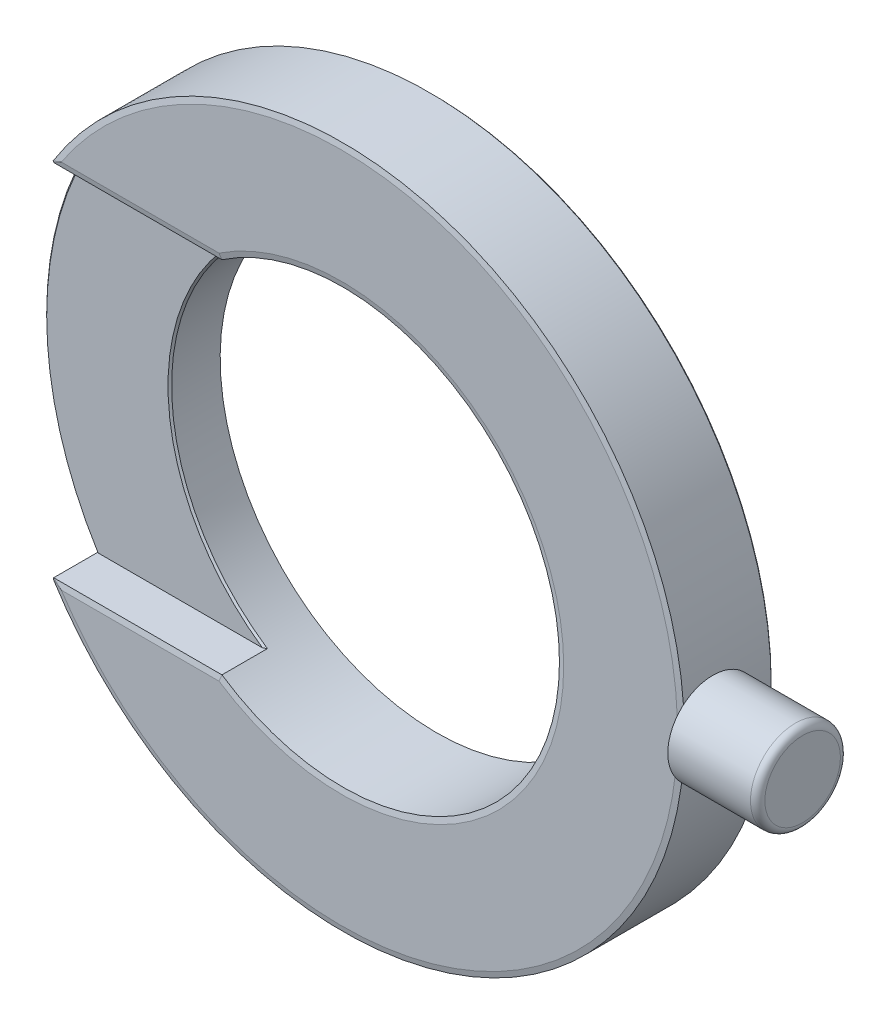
ISO-10303-21;
HEADER;
FILE_DESCRIPTION(('STEP AP214'),'2;1');
FILE_NAME('part.step','',(''),(''),'','','');
FILE_SCHEMA(('AUTOMOTIVE_DESIGN { 1 0 10303 214 1 1 1 1 }'));
ENDSEC;
DATA;
#1=APPLICATION_CONTEXT('core data for automotive mechanical design processes');
#2=APPLICATION_PROTOCOL_DEFINITION('international standard','automotive_design',2000,#1);
#3=PRODUCT_CONTEXT('',#1,'mechanical');
#4=PRODUCT('Part','Part','',(#3));
#5=PRODUCT_RELATED_PRODUCT_CATEGORY('part','',(#4));
#6=PRODUCT_DEFINITION_FORMATION('','',#4);
#7=PRODUCT_DEFINITION_CONTEXT('part definition',#1,'design');
#8=PRODUCT_DEFINITION('design','',#6,#7);
#9=PRODUCT_DEFINITION_SHAPE('','',#8);
#10=(LENGTH_UNIT() NAMED_UNIT(*) SI_UNIT(.MILLI.,.METRE.));
#11=(NAMED_UNIT(*) PLANE_ANGLE_UNIT() SI_UNIT($,.RADIAN.));
#12=(NAMED_UNIT(*) SI_UNIT($,.STERADIAN.) SOLID_ANGLE_UNIT());
#13=UNCERTAINTY_MEASURE_WITH_UNIT(LENGTH_MEASURE(1.E-05),#10,'distance_accuracy_value','');
#14=(GEOMETRIC_REPRESENTATION_CONTEXT(3) GLOBAL_UNCERTAINTY_ASSIGNED_CONTEXT((#13)) GLOBAL_UNIT_ASSIGNED_CONTEXT((#10,
#11,#12)) REPRESENTATION_CONTEXT('',''));
#15=CARTESIAN_POINT('',(0.,0.,0.));
#16=DIRECTION('',(0.,0.,1.));
#17=DIRECTION('',(1.,0.,0.));
#18=AXIS2_PLACEMENT_3D('',#15,#16,#17);
#19=CARTESIAN_POINT('',(0.,0.,1.5));
#20=DIRECTION('',(0.,0.,-1.));
#21=DIRECTION('',(-1.,0.,0.));
#22=AXIS2_PLACEMENT_3D('',#19,#20,#21);
#23=PLANE('',#22);
#24=CARTESIAN_POINT('',(0.,0.,1.5));
#25=DIRECTION('',(0.,0.,-1.));
#26=DIRECTION('',(-1.,0.,0.));
#27=AXIS2_PLACEMENT_3D('',#24,#25,#26);
#28=CIRCLE('',#27,94.5);
#29=CARTESIAN_POINT('',(-94.5,0.,1.5));
#30=VERTEX_POINT('',#29);
#31=EDGE_CURVE('E340',#30,#30,#28,.T.);
#32=ORIENTED_EDGE('',*,*,#31,.T.);
#33=EDGE_LOOP('',(#32));
#34=FACE_BOUND('',#33,.T.);
#35=CARTESIAN_POINT('',(0.,0.,1.5));
#36=DIRECTION('',(0.,0.,-1.));
#37=DIRECTION('',(1.,0.,0.));
#38=AXIS2_PLACEMENT_3D('',#35,#36,#37);
#39=CIRCLE('',#38,63.25);
#40=CARTESIAN_POINT('',(63.25,0.,1.5));
#41=VERTEX_POINT('',#40);
#42=EDGE_CURVE('E453',#41,#41,#39,.T.);
#43=ORIENTED_EDGE('',*,*,#42,.F.);
#44=EDGE_LOOP('',(#43));
#45=FACE_BOUND('',#44,.T.);
#46=ADVANCED_FACE('F15',(#34,#45),#23,.T.);
#47=CARTESIAN_POINT('',(97.250000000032,-12.5,20.5));
#48=DIRECTION('',(-1.,0.,0.));
#49=DIRECTION('',(0.,-1.,0.));
#50=AXIS2_PLACEMENT_3D('',#47,#48,#49);
#51=PLANE('',#50);
#52=CARTESIAN_POINT('',(97.250000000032,0.,20.5));
#53=DIRECTION('',(-1.,0.,0.));
#54=DIRECTION('',(0.,-1.,0.));
#55=AXIS2_PLACEMENT_3D('',#52,#53,#54);
#56=CIRCLE('',#55,3.99999999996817);
#57=CARTESIAN_POINT('',(97.250000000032,-3.99999999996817,20.5));
#58=VERTEX_POINT('',#57);
#59=EDGE_CURVE('E28',#58,#58,#56,.F.);
#60=ORIENTED_EDGE('',*,*,#59,.T.);
#61=EDGE_LOOP('',(#60));
#62=FACE_BOUND('',#61,.T.);
#63=CARTESIAN_POINT('',(97.250000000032,0.,20.5));
#64=DIRECTION('',(1.,0.,0.));
#65=DIRECTION('',(0.,1.,0.));
#66=AXIS2_PLACEMENT_3D('',#63,#64,#65);
#67=CIRCLE('',#66,12.5);
#68=CARTESIAN_POINT('',(97.250000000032,12.5,20.5));
#69=VERTEX_POINT('',#68);
#70=EDGE_CURVE('E708',#69,#69,#67,.T.);
#71=ORIENTED_EDGE('',*,*,#70,.F.);
#72=EDGE_LOOP('',(#71));
#73=FACE_BOUND('',#72,.T.);
#74=ADVANCED_FACE('F261',(#62,#73),#51,.T.);
#75=CARTESIAN_POINT('',(97.250000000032,0.,20.5));
#76=DIRECTION('',(1.,0.,0.));
#77=DIRECTION('',(0.,1.,0.));
#78=AXIS2_PLACEMENT_3D('',#75,#76,#77);
#79=CYLINDRICAL_SURFACE('',#78,12.5);
#80=CARTESIAN_POINT('',(120.250000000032,0.,20.5));
#81=DIRECTION('',(1.,0.,0.));
#82=DIRECTION('',(0.,1.,0.));
#83=AXIS2_PLACEMENT_3D('',#80,#81,#82);
#84=CIRCLE('',#83,12.5);
#85=CARTESIAN_POINT('',(120.250000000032,12.5,20.5));
#86=VERTEX_POINT('',#85);
#87=EDGE_CURVE('E703',#86,#86,#84,.T.);
#88=ORIENTED_EDGE('',*,*,#87,.F.);
#89=EDGE_LOOP('',(#88));
#90=FACE_BOUND('',#89,.T.);
#91=ORIENTED_EDGE('',*,*,#70,.T.);
#92=EDGE_LOOP('',(#91));
#93=FACE_BOUND('',#92,.T.);
#94=ADVANCED_FACE('F264',(#90,#93),#79,.T.);
#95=CARTESIAN_POINT('',(120.250000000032,0.,20.5));
#96=DIRECTION('',(1.,0.,0.));
#97=DIRECTION('',(0.,1.,0.));
#98=AXIS2_PLACEMENT_3D('',#95,#96,#97);
#99=TOROIDAL_SURFACE('',#98,10.5,2.);
#100=CARTESIAN_POINT('',(122.250000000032,0.,20.5));
#101=DIRECTION('',(1.,0.,0.));
#102=DIRECTION('',(0.,1.,0.));
#103=AXIS2_PLACEMENT_3D('',#100,#101,#102);
#104=CIRCLE('',#103,10.5);
#105=CARTESIAN_POINT('',(122.250000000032,10.5,20.5));
#106=VERTEX_POINT('',#105);
#107=EDGE_CURVE('E464',#106,#106,#104,.T.);
#108=ORIENTED_EDGE('',*,*,#107,.F.);
#109=EDGE_LOOP('',(#108));
#110=FACE_BOUND('',#109,.T.);
#111=ORIENTED_EDGE('',*,*,#87,.T.);
#112=EDGE_LOOP('',(#111));
#113=FACE_BOUND('',#112,.T.);
#114=ADVANCED_FACE('F259',(#110,#113),#99,.T.);
#115=CARTESIAN_POINT('',(122.250000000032,0.,20.5));
#116=DIRECTION('',(1.,0.,0.));
#117=DIRECTION('',(0.,0.,-1.));
#118=AXIS2_PLACEMENT_3D('',#115,#116,#117);
#119=PLANE('',#118);
#120=ORIENTED_EDGE('',*,*,#107,.T.);
#121=EDGE_LOOP('',(#120));
#122=FACE_BOUND('',#121,.T.);
#123=ADVANCED_FACE('F241',(#122),#119,.T.);
#124=CARTESIAN_POINT('',(115.250000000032,0.,20.5));
#125=DIRECTION('',(-1.,0.,0.));
#126=DIRECTION('',(0.,-1.,0.));
#127=AXIS2_PLACEMENT_3D('',#124,#125,#126);
#128=CYLINDRICAL_SURFACE('',#127,3.99999999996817);
#129=ORIENTED_EDGE('',*,*,#59,.F.);
#130=EDGE_LOOP('',(#129));
#131=FACE_BOUND('',#130,.T.);
#132=CARTESIAN_POINT('',(94.9157521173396,-3.99999999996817,20.5));
#133=CARTESIAN_POINT('',(94.9157532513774,-3.99999007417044,20.7245748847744));
#134=CARTESIAN_POINT('',(94.916557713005,-3.98102379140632,20.9493100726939));
#135=CARTESIAN_POINT('',(94.9196892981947,-3.90563082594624,21.3925837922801));
#136=CARTESIAN_POINT('',(94.9220182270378,-3.84915972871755,21.6111146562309));
#137=CARTESIAN_POINT('',(94.9279344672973,-3.70037416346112,22.0354941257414));
#138=CARTESIAN_POINT('',(94.9315211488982,-3.60807763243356,22.2413490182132));
#139=CARTESIAN_POINT('',(94.939547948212,-3.39028788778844,22.634587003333));
#140=CARTESIAN_POINT('',(94.9439878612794,-3.26480263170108,22.8219745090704));
#141=CARTESIAN_POINT('',(94.9532247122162,-2.98408980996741,23.1731574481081));
#142=CARTESIAN_POINT('',(94.9580218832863,-2.82884271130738,23.3369372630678));
#143=CARTESIAN_POINT('',(94.9674304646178,-2.49305079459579,23.636123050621));
#144=CARTESIAN_POINT('',(94.9720418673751,-2.31250495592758,23.7715278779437));
#145=CARTESIAN_POINT('',(94.980560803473,-1.93116545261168,24.010157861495));
#146=CARTESIAN_POINT('',(94.9844680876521,-1.73036465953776,24.1133716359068));
#147=CARTESIAN_POINT('',(94.9911362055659,-1.31426560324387,24.2846163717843));
#148=CARTESIAN_POINT('',(94.9938970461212,-1.09896742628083,24.3526475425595));
#149=CARTESIAN_POINT('',(94.9979596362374,-0.660121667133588,24.4515568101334));
#150=CARTESIAN_POINT('',(94.9992622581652,-0.436579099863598,24.4824571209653));
#151=CARTESIAN_POINT('',(95.0002645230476,0.0125237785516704,24.5062960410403));
#152=CARTESIAN_POINT('',(94.999964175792,0.238084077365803,24.4992348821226));
#153=CARTESIAN_POINT('',(94.9977950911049,0.684669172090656,24.4473698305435));
#154=CARTESIAN_POINT('',(94.9959273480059,0.905696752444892,24.4025898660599));
#155=CARTESIAN_POINT('',(94.9908350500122,1.33709470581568,24.276595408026));
#156=CARTESIAN_POINT('',(94.9876104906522,1.5474650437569,24.1953807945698));
#157=CARTESIAN_POINT('',(94.9801661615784,1.9516539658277,23.9987950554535));
#158=CARTESIAN_POINT('',(94.9759460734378,2.14546722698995,23.883412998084));
#159=CARTESIAN_POINT('',(94.9669860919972,2.51098210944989,23.621775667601));
#160=CARTESIAN_POINT('',(94.9622461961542,2.68268362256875,23.4755202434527));
#161=CARTESIAN_POINT('',(94.9527762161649,2.99924054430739,23.1561524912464));
#162=CARTESIAN_POINT('',(94.9480461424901,3.14407501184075,22.9830194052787));
#163=CARTESIAN_POINT('',(94.939132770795,3.40262525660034,22.6148839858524));
#164=CARTESIAN_POINT('',(94.9349494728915,3.51634102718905,22.4198816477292));
#165=CARTESIAN_POINT('',(94.9276016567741,3.70942388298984,22.0135308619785));
#166=CARTESIAN_POINT('',(94.9244371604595,3.7887902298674,21.802182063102));
#167=CARTESIAN_POINT('',(94.9194846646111,3.91090756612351,21.3691433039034));
#168=CARTESIAN_POINT('',(94.9176966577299,3.95365875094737,21.1474533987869));
#169=CARTESIAN_POINT('',(94.9157001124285,4.00130640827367,20.7002077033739));
#170=CARTESIAN_POINT('',(94.9154903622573,4.00623192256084,20.474655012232));
#171=CARTESIAN_POINT('',(94.9166708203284,3.97816416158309,20.025926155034));
#172=CARTESIAN_POINT('',(94.9180610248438,3.94517097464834,19.8027499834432));
#173=CARTESIAN_POINT('',(94.9222835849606,3.84222643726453,19.3651906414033));
#174=CARTESIAN_POINT('',(94.9251154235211,3.77228833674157,19.1508043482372));
#175=CARTESIAN_POINT('',(94.9319016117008,3.59745267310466,18.7368143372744));
#176=CARTESIAN_POINT('',(94.935855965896,3.4925549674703,18.5372106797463));
#177=CARTESIAN_POINT('',(94.9444444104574,3.25070306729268,18.1583182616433));
#178=CARTESIAN_POINT('',(94.9490789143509,3.11372934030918,17.9790419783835));
#179=CARTESIAN_POINT('',(94.9585038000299,2.81164217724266,17.6460187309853));
#180=CARTESIAN_POINT('',(94.9632941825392,2.64652861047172,17.4922718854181));
#181=CARTESIAN_POINT('',(94.9724943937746,2.29272414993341,17.2145745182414));
#182=CARTESIAN_POINT('',(94.9769039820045,2.10401853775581,17.090642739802));
#183=CARTESIAN_POINT('',(94.9848421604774,1.70846130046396,16.8762215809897));
#184=CARTESIAN_POINT('',(94.9883707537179,1.50160973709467,16.7857320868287));
#185=CARTESIAN_POINT('',(94.9941480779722,1.07570250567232,16.6407970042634));
#186=CARTESIAN_POINT('',(94.9963972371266,0.856650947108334,16.5863393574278));
#187=CARTESIAN_POINT('',(94.9993638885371,0.412504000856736,16.5149743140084));
#188=CARTESIAN_POINT('',(95.0000813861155,0.187408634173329,16.4980667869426));
#189=CARTESIAN_POINT('',(94.9999038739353,-0.26224985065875,16.5022832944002));
#190=CARTESIAN_POINT('',(94.9990101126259,-0.486813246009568,16.5233778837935));
#191=CARTESIAN_POINT('',(94.9957131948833,-0.929207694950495,16.6029390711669));
#192=CARTESIAN_POINT('',(94.9933100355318,-1.1470387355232,16.6614057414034));
#193=CARTESIAN_POINT('',(94.9872648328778,-1.569792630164,16.8140459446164));
#194=CARTESIAN_POINT('',(94.9836227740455,-1.77471532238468,16.9082199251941));
#195=CARTESIAN_POINT('',(94.9755097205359,-2.16584072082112,17.1295952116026));
#196=CARTESIAN_POINT('',(94.97103875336,-2.35204404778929,17.2567954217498));
#197=CARTESIAN_POINT('',(94.9617675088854,-2.70058946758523,17.5407135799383));
#198=CARTESIAN_POINT('',(94.9569670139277,-2.86291556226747,17.6974511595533));
#199=CARTESIAN_POINT('',(94.9475788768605,-3.1589985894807,18.035998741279));
#200=CARTESIAN_POINT('',(94.9429912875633,-3.29274846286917,18.2178149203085));
#201=CARTESIAN_POINT('',(94.934543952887,-3.52792680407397,18.6014687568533));
#202=CARTESIAN_POINT('',(94.9306848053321,-3.62932877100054,18.8033226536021));
#203=CARTESIAN_POINT('',(94.9241395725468,-3.79668366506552,19.2210531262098));
#204=CARTESIAN_POINT('',(94.9214520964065,-3.86267864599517,19.4369127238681));
#205=CARTESIAN_POINT('',(94.918267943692,-3.93995421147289,19.7951031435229));
#206=CARTESIAN_POINT('',(94.9173286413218,-3.96244282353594,19.9351116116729));
#207=CARTESIAN_POINT('',(94.9160703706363,-3.99246884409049,20.2167254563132));
#208=CARTESIAN_POINT('',(94.9157514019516,-4.00000626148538,20.3583308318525));
#209=CARTESIAN_POINT('',(94.9157521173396,-3.99999999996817,20.5));
#210=B_SPLINE_CURVE_WITH_KNOTS('',3,(#132,#133,#134,#135,#136,#137,#138,#139,#140,#141,#142,
#143,#144,#145,#146,#147,#148,#149,#150,#151,#152,#153,#154,#155,#156,#157,#158,#159,#160,#161,
#162,#163,#164,#165,#166,#167,#168,#169,#170,#171,#172,#173,#174,#175,#176,#177,#178,#179,#180,
#181,#182,#183,#184,#185,#186,#187,#188,#189,#190,#191,#192,#193,#194,#195,#196,#197,#198,#199,
#200,#201,#202,#203,#204,#205,#206,#207,#208,#209),.UNSPECIFIED.,.T.,.F.,(4,2,2,2,2,2,2,2,2,2,2,
2,2,2,2,2,2,2,2,2,2,2,2,2,2,2,2,2,2,2,2,2,2,2,2,2,2,2,4),(0.,0.673207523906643,1.34721370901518,
2.02088286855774,2.69439065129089,3.36834198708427,4.04232051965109,4.71653708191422,
5.39074963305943,6.06455862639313,6.73836350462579,7.41174125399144,8.08512121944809,
8.75871686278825,9.43231580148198,10.1064375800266,10.7805595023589,11.454695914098,
12.1288287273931,12.8024439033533,13.476057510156,14.1494296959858,14.8228046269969,
15.4965906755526,16.170379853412,16.8445915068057,17.5188008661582,18.1927844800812,
18.8667657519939,19.5402250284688,20.2136856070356,20.8871546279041,21.5606013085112,
22.2344971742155,22.9085593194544,23.583172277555,24.2569821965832,24.6816637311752,
25.1063450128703),.UNSPECIFIED.);
#211=CARTESIAN_POINT('',(94.9157521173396,-3.99999999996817,20.5));
#212=VERTEX_POINT('',#211);
#213=EDGE_CURVE('E226',#212,#212,#210,.T.);
#214=ORIENTED_EDGE('',*,*,#213,.F.);
#215=EDGE_LOOP('',(#214));
#216=FACE_BOUND('',#215,.T.);
#217=ADVANCED_FACE('F218',(#131,#216),#128,.T.);
#218=CARTESIAN_POINT('',(60.25,0.,20.5));
#219=DIRECTION('',(1.,0.,0.));
#220=DIRECTION('',(0.,1.,0.));
#221=AXIS2_PLACEMENT_3D('',#218,#219,#220);
#222=CONICAL_SURFACE('',#221,2.9999999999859,0.785398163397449);
#223=CARTESIAN_POINT('',(60.25,0.,20.5));
#224=DIRECTION('',(-1.,0.,0.));
#225=DIRECTION('',(0.,-1.,0.));
#226=AXIS2_PLACEMENT_3D('',#223,#224,#225);
#227=CIRCLE('',#226,2.9999999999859);
#228=CARTESIAN_POINT('',(60.25,-2.9999999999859,20.5));
#229=VERTEX_POINT('',#228);
#230=EDGE_CURVE('E460',#229,#229,#227,.T.);
#231=ORIENTED_EDGE('',*,*,#230,.F.);
#232=EDGE_LOOP('',(#231));
#233=FACE_BOUND('',#232,.T.);
#234=CARTESIAN_POINT('',(60.6500000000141,0.,20.5));
#235=DIRECTION('',(1.,0.,0.));
#236=DIRECTION('',(0.,1.,0.));
#237=AXIS2_PLACEMENT_3D('',#234,#235,#236);
#238=CIRCLE('',#237,3.4);
#239=CARTESIAN_POINT('',(60.6500000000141,3.4,20.5));
#240=VERTEX_POINT('',#239);
#241=EDGE_CURVE('E234',#240,#240,#238,.F.);
#242=ORIENTED_EDGE('',*,*,#241,.T.);
#243=EDGE_LOOP('',(#242));
#244=FACE_BOUND('',#243,.T.);
#245=ADVANCED_FACE('F240',(#233,#244),#222,.T.);
#246=CARTESIAN_POINT('',(60.25,0.,20.5));
#247=DIRECTION('',(-1.,0.,0.));
#248=DIRECTION('',(0.,-1.,0.));
#249=AXIS2_PLACEMENT_3D('',#246,#247,#248);
#250=PLANE('',#249);
#251=ORIENTED_EDGE('',*,*,#230,.T.);
#252=EDGE_LOOP('',(#251));
#253=FACE_BOUND('',#252,.T.);
#254=ADVANCED_FACE('F216',(#253),#250,.T.);
#255=CARTESIAN_POINT('',(0.,0.,26.5));
#256=DIRECTION('',(0.,0.,1.));
#257=DIRECTION('',(1.,0.,0.));
#258=AXIS2_PLACEMENT_3D('',#255,#256,#257);
#259=CONICAL_SURFACE('',#258,61.7998990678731,1.33965999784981);
#260=CARTESIAN_POINT('',(0.,0.,26.1352431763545));
#261=DIRECTION('',(0.,0.,1.));
#262=DIRECTION('',(1.,0.,0.));
#263=AXIS2_PLACEMENT_3D('',#260,#261,#262);
#264=CIRCLE('',#263,60.25);
#265=CARTESIAN_POINT('',(-33.6164022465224,-50.,26.1352431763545));
#266=VERTEX_POINT('',#265);
#267=CARTESIAN_POINT('',(-33.6164022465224,50.,26.1352431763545));
#268=VERTEX_POINT('',#267);
#269=EDGE_CURVE('E393',#266,#268,#264,.T.);
#270=ORIENTED_EDGE('',*,*,#269,.F.);
#271=CARTESIAN_POINT('',(389.63811040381,-172.276727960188,54.9121305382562));
#272=DIRECTION('',(2.69255548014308E-12,-0.229083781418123,-0.973406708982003));
#273=DIRECTION('',(-0.958669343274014,0.27695617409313,-0.0651795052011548));
#274=AXIS2_PLACEMENT_3D('',#271,#272,#273);
#275=CIRCLE('',#274,441.502083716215);
#276=CARTESIAN_POINT('',(-34.0857071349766,-51.5498990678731,26.5));
#277=VERTEX_POINT('',#276);
#278=EDGE_CURVE('E388',#277,#266,#275,.T.);
#279=ORIENTED_EDGE('',*,*,#278,.F.);
#280=CARTESIAN_POINT('',(0.,0.,26.5));
#281=DIRECTION('',(0.,0.,-1.));
#282=DIRECTION('',(1.,0.,0.));
#283=AXIS2_PLACEMENT_3D('',#280,#281,#282);
#284=CIRCLE('',#283,61.7998990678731);
#285=CARTESIAN_POINT('',(-34.0857071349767,51.5498990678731,26.5));
#286=VERTEX_POINT('',#285);
#287=EDGE_CURVE('E392',#286,#277,#284,.T.);
#288=ORIENTED_EDGE('',*,*,#287,.F.);
#289=CARTESIAN_POINT('',(389.638110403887,172.276727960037,54.9121305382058));
#290=DIRECTION('',(-2.66336566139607E-12,-0.229083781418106,0.973406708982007));
#291=DIRECTION('',(-0.958669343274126,-0.27695617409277,-0.0651795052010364));
#292=AXIS2_PLACEMENT_3D('',#289,#290,#291);
#293=CIRCLE('',#292,441.502083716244);
#294=EDGE_CURVE('E145',#286,#268,#293,.T.);
#295=ORIENTED_EDGE('',*,*,#294,.T.);
#296=EDGE_LOOP('',(#270,#279,#288,#295));
#297=FACE_BOUND('',#296,.T.);
#298=ADVANCED_FACE('F204',(#297),#259,.F.);
#299=CARTESIAN_POINT('',(0.,0.,1.5));
#300=DIRECTION('',(0.,0.,1.));
#301=DIRECTION('',(1.,0.,0.));
#302=AXIS2_PLACEMENT_3D('',#299,#300,#301);
#303=CONICAL_SURFACE('',#302,94.5,0.785398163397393);
#304=CARTESIAN_POINT('',(0.,0.,2.));
#305=DIRECTION('',(0.,0.,1.));
#306=DIRECTION('',(-1.,0.,0.));
#307=AXIS2_PLACEMENT_3D('',#304,#305,#306);
#308=CIRCLE('',#307,95.);
#309=CARTESIAN_POINT('',(-95.,0.,2.));
#310=VERTEX_POINT('',#309);
#311=EDGE_CURVE('E336',#310,#310,#308,.T.);
#312=ORIENTED_EDGE('',*,*,#311,.F.);
#313=EDGE_LOOP('',(#312));
#314=FACE_BOUND('',#313,.T.);
#315=ORIENTED_EDGE('',*,*,#31,.F.);
#316=EDGE_LOOP('',(#315));
#317=FACE_BOUND('',#316,.T.);
#318=ADVANCED_FACE('F200',(#314,#317),#303,.T.);
#319=CARTESIAN_POINT('',(0.,0.,14.));
#320=DIRECTION('',(0.,0.,-1.));
#321=DIRECTION('',(-1.,0.,0.));
#322=AXIS2_PLACEMENT_3D('',#319,#320,#321);
#323=CONICAL_SURFACE('',#322,94.5,0.785398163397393);
#324=CARTESIAN_POINT('',(0.,0.,14.));
#325=DIRECTION('',(0.,0.,1.));
#326=DIRECTION('',(1.,0.,0.));
#327=AXIS2_PLACEMENT_3D('',#324,#325,#326);
#328=CIRCLE('',#327,94.5);
#329=CARTESIAN_POINT('',(-80.1888396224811,50.,14.));
#330=VERTEX_POINT('',#329);
#331=CARTESIAN_POINT('',(-80.1888396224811,-50.,14.));
#332=VERTEX_POINT('',#331);
#333=EDGE_CURVE('E162',#330,#332,#328,.T.);
#334=ORIENTED_EDGE('',*,*,#333,.F.);
#335=DIRECTION('',(0.762433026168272,0.,0.647067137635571));
#336=VECTOR('',#335,1.);
#337=CARTESIAN_POINT('',(-80.2753460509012,50.,13.9265831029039));
#338=LINE('',#337,#336);
#339=CARTESIAN_POINT('',(-80.2753460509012,50.,13.9265831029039));
#340=VERTEX_POINT('',#339);
#341=EDGE_CURVE('E324',#340,#330,#338,.T.);
#342=ORIENTED_EDGE('',*,*,#341,.F.);
#343=CARTESIAN_POINT('',(-80.2753460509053,49.9999999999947,13.9265831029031));
#344=CARTESIAN_POINT('',(-80.42981794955,50.1544718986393,13.7137973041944));
#345=CARTESIAN_POINT('',(-80.5849866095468,50.3096405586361,13.4999999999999));
#346=(BOUNDED_CURVE() B_SPLINE_CURVE(2,(#343,#344,#345),.UNSPECIFIED.,.F.,
.F.) B_SPLINE_CURVE_WITH_KNOTS((3,3),(-0.189217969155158,-0.132312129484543),
.UNSPECIFIED.) CURVE() GEOMETRIC_REPRESENTATION_ITEM() RATIONAL_B_SPLINE_CURVE((1.00059581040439,
1.00051508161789,1.0004290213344)) REPRESENTATION_ITEM(''));
#347=CARTESIAN_POINT('',(-80.5849866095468,50.3096405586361,13.5));
#348=VERTEX_POINT('',#347);
#349=EDGE_CURVE('E329',#340,#348,#346,.T.);
#350=ORIENTED_EDGE('',*,*,#349,.T.);
#351=CARTESIAN_POINT('',(0.,0.,13.5));
#352=DIRECTION('',(0.,0.,-1.));
#353=DIRECTION('',(1.,0.,0.));
#354=AXIS2_PLACEMENT_3D('',#351,#352,#353);
#355=CIRCLE('',#354,95.);
#356=CARTESIAN_POINT('',(-80.5127675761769,-50.4251351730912,13.5));
#357=VERTEX_POINT('',#356);
#358=EDGE_CURVE('E380',#357,#348,#355,.T.);
#359=ORIENTED_EDGE('',*,*,#358,.F.);
#360=CARTESIAN_POINT('',(-80.5127675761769,-50.4251351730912,13.5));
#361=CARTESIAN_POINT('',(-80.4794347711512,-50.2834997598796,13.6034284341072));
#362=CARTESIAN_POINT('',(-80.4460840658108,-50.1417882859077,13.7067470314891));
#363=CARTESIAN_POINT('',(-80.412715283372,-50.,13.8099541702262));
#364=(BOUNDED_CURVE() B_SPLINE_CURVE(3,(#360,#361,#362,#363),.UNSPECIFIED.,.F.,
.F.) B_SPLINE_CURVE_WITH_KNOTS((4,4),(0.,0.000535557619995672),
.UNSPECIFIED.) CURVE() GEOMETRIC_REPRESENTATION_ITEM() RATIONAL_B_SPLINE_CURVE((1.,1.,1.,1.)) REPRESENTATION_ITEM(''));
#365=CARTESIAN_POINT('',(-80.412715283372,-50.,13.8099541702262));
#366=VERTEX_POINT('',#365);
#367=EDGE_CURVE('E355',#357,#366,#364,.T.);
#368=ORIENTED_EDGE('',*,*,#367,.T.);
#369=CARTESIAN_POINT('',(-80.1888396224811,-50.,14.));
#370=CARTESIAN_POINT('',(-80.2634770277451,-50.,13.9366657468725));
#371=CARTESIAN_POINT('',(-80.338102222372,-50.,13.873317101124));
#372=CARTESIAN_POINT('',(-80.412715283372,-50.,13.8099541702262));
#373=(BOUNDED_CURVE() B_SPLINE_CURVE(3,(#369,#370,#371,#372),.UNSPECIFIED.,.F.,
.F.) B_SPLINE_CURVE_WITH_KNOTS((4,4),(0.,0.00029366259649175),
.UNSPECIFIED.) CURVE() GEOMETRIC_REPRESENTATION_ITEM() RATIONAL_B_SPLINE_CURVE((1.,1.,1.,1.)) REPRESENTATION_ITEM(''));
#374=EDGE_CURVE('E334',#332,#366,#373,.T.);
#375=ORIENTED_EDGE('',*,*,#374,.F.);
#376=EDGE_LOOP('',(#334,#342,#350,#359,#368,#375));
#377=FACE_BOUND('',#376,.T.);
#378=ADVANCED_FACE('F203',(#377),#323,.T.);
#379=CARTESIAN_POINT('',(95.,0.,20.5));
#380=DIRECTION('',(1.,0.,0.));
#381=DIRECTION('',(0.,1.,0.));
#382=AXIS2_PLACEMENT_3D('',#379,#380,#381);
#383=CYLINDRICAL_SURFACE('',#382,3.4);
#384=ORIENTED_EDGE('',*,*,#241,.F.);
#385=EDGE_LOOP('',(#384));
#386=FACE_BOUND('',#385,.T.);
#387=CARTESIAN_POINT('',(60.25,-1.26403377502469E-13,23.9));
#388=CARTESIAN_POINT('',(60.2500002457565,-0.0542884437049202,23.9000042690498));
#389=CARTESIAN_POINT('',(60.2499266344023,-0.108574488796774,23.8986545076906));
#390=CARTESIAN_POINT('',(60.2496327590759,-0.217287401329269,23.8932862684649));
#391=CARTESIAN_POINT('',(60.2494117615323,-0.271713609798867,23.8892544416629));
#392=CARTESIAN_POINT('',(60.2488220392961,-0.380705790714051,23.8785229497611));
#393=CARTESIAN_POINT('',(60.2484522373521,-0.43526983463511,23.8718038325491));
#394=CARTESIAN_POINT('',(60.2475641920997,-0.544538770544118,23.8557068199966));
#395=CARTESIAN_POINT('',(60.2470445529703,-0.599239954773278,23.8463039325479));
#396=CARTESIAN_POINT('',(60.2458460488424,-0.70969732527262,23.8246590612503));
#397=CARTESIAN_POINT('',(60.2451630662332,-0.765439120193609,23.8123437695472));
#398=CARTESIAN_POINT('',(60.2436600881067,-0.875747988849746,23.785094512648));
#399=CARTESIAN_POINT('',(60.2428413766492,-0.930321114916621,23.7701850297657));
#400=CARTESIAN_POINT('',(60.2410768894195,-1.03829245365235,23.737755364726));
#401=CARTESIAN_POINT('',(60.2401319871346,-1.09169604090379,23.7202530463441));
#402=CARTESIAN_POINT('',(60.2381248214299,-1.1973291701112,23.6826445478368));
#403=CARTESIAN_POINT('',(60.237063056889,-1.2495626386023,23.6625493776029));
#404=CARTESIAN_POINT('',(60.234830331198,-1.35291761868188,23.6197349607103));
#405=CARTESIAN_POINT('',(60.2336594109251,-1.40403953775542,23.597016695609));
#406=CARTESIAN_POINT('',(60.2312142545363,-1.50529248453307,23.5489251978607));
#407=CARTESIAN_POINT('',(60.2299395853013,-1.5554181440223,23.523540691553));
#408=CARTESIAN_POINT('',(60.2272945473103,-1.65468235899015,23.4701236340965));
#409=CARTESIAN_POINT('',(60.2259235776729,-1.7038116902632,23.4420739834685));
#410=CARTESIAN_POINT('',(60.2230933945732,-1.80108640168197,23.383331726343));
#411=CARTESIAN_POINT('',(60.2216334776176,-1.84921833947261,23.3526169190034));
#412=CARTESIAN_POINT('',(60.2186920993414,-1.94261192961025,23.2898235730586));
#413=CARTESIAN_POINT('',(60.21721242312,-1.98791627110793,23.2578084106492));
#414=CARTESIAN_POINT('',(60.2142217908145,-2.07652137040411,23.1919528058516));
#415=CARTESIAN_POINT('',(60.212711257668,-2.11983692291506,23.1581322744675));
#416=CARTESIAN_POINT('',(60.2096720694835,-2.20446578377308,23.0886707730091));
#417=CARTESIAN_POINT('',(60.2081436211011,-2.24579118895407,23.0530445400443));
#418=CARTESIAN_POINT('',(60.2050810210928,-2.32644363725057,22.9799773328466));
#419=CARTESIAN_POINT('',(60.2035469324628,-2.36577935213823,22.9425459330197));
#420=CARTESIAN_POINT('',(60.2004815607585,-2.44253871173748,22.8657882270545));
#421=CARTESIAN_POINT('',(60.1989502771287,-2.47996278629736,22.8264623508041));
#422=CARTESIAN_POINT('',(60.19589630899,-2.55301998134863,22.74582267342));
#423=CARTESIAN_POINT('',(60.1943737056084,-2.58864322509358,22.7044999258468));
#424=CARTESIAN_POINT('',(60.191346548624,-2.65810423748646,22.6198703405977));
#425=CARTESIAN_POINT('',(60.189842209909,-2.69192696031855,22.5765511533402));
#426=CARTESIAN_POINT('',(60.1868604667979,-2.75779347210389,22.4879334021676));
#427=CARTESIAN_POINT('',(60.1853834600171,-2.78981704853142,22.4426198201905));
#428=CARTESIAN_POINT('',(60.1824404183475,-2.85260933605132,22.3492318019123));
#429=CARTESIAN_POINT('',(60.1809759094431,-2.8833158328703,22.3011154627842));
#430=CARTESIAN_POINT('',(60.1781332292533,-2.94204659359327,22.2038616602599));
#431=CARTESIAN_POINT('',(60.1767543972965,-2.97009259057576,22.1547373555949));
#432=CARTESIAN_POINT('',(60.1740941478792,-3.02350853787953,22.0554732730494));
#433=CARTESIAN_POINT('',(60.172812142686,-3.04889506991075,22.0053424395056));
#434=CARTESIAN_POINT('',(60.1703554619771,-3.09699875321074,21.9040696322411));
#435=CARTESIAN_POINT('',(60.1691803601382,-3.1197266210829,21.8529327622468));
#436=CARTESIAN_POINT('',(60.1669452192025,-3.16254052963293,21.7495889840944));
#437=CARTESIAN_POINT('',(60.1658851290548,-3.18262774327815,21.6973825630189));
#438=CARTESIAN_POINT('',(60.1638845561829,-3.22022533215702,21.5917855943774));
#439=CARTESIAN_POINT('',(60.1629446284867,-3.23772380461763,21.5383908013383));
#440=CARTESIAN_POINT('',(60.161190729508,-3.27015222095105,21.4304194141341));
#441=CARTESIAN_POINT('',(60.1603776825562,-3.28506339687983,21.3758371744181));
#442=CARTESIAN_POINT('',(60.1588829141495,-3.31232468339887,21.2654924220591));
#443=CARTESIAN_POINT('',(60.1582024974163,-3.32464943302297,21.2097236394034));
#444=CARTESIAN_POINT('',(60.1570022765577,-3.34629505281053,21.0992855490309));
#445=CARTESIAN_POINT('',(60.1564783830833,-3.35569274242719,21.044631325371));
#446=CARTESIAN_POINT('',(60.1555786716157,-3.37178280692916,20.9354252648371));
#447=CARTESIAN_POINT('',(60.1552015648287,-3.37849874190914,20.8808769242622));
#448=CARTESIAN_POINT('',(60.1545978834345,-3.38923032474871,20.7718855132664));
#449=CARTESIAN_POINT('',(60.154370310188,-3.3932638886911,20.7174442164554));
#450=CARTESIAN_POINT('',(60.1540668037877,-3.39864005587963,20.6086682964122));
#451=CARTESIAN_POINT('',(60.1539902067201,-3.39999444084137,20.5543342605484));
#452=CARTESIAN_POINT('',(60.1539895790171,-3.40000554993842,20.4457558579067));
#453=CARTESIAN_POINT('',(60.1540652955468,-3.39866674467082,20.3915114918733));
#454=CARTESIAN_POINT('',(60.1543676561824,-3.3933109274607,20.282855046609));
#455=CARTESIAN_POINT('',(60.1545951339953,-3.38927912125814,20.2284437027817));
#456=CARTESIAN_POINT('',(60.1551988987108,-3.37854621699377,20.1194522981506));
#457=CARTESIAN_POINT('',(60.1555763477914,-3.37182426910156,20.0648743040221));
#458=CARTESIAN_POINT('',(60.1564769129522,-3.3557191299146,19.9555482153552));
#459=CARTESIAN_POINT('',(60.1570014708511,-3.34630957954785,19.9008040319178));
#460=CARTESIAN_POINT('',(60.1582018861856,-3.32466046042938,19.7903167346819));
#461=CARTESIAN_POINT('',(60.1588815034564,-3.31235026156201,19.7345874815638));
#462=CARTESIAN_POINT('',(60.1603752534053,-3.28510784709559,19.6242954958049));
#463=CARTESIAN_POINT('',(60.1611881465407,-3.27019972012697,19.5697268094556));
#464=CARTESIAN_POINT('',(60.1629421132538,-3.23777056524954,19.4617556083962));
#465=CARTESIAN_POINT('',(60.1638823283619,-3.2202669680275,19.4083478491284));
#466=CARTESIAN_POINT('',(60.1658837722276,-3.18265347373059,19.3026972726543));
#467=CARTESIAN_POINT('',(60.1669445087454,-3.16255413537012,19.2504506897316));
#468=CARTESIAN_POINT('',(60.169179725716,-3.11973877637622,19.1470897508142));
#469=CARTESIAN_POINT('',(60.170354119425,-3.09702474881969,19.0959745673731));
#470=CARTESIAN_POINT('',(60.1728098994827,-3.04893928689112,18.9947307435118));
#471=CARTESIAN_POINT('',(60.1740917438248,-3.02355634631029,18.9446075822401));
#472=CARTESIAN_POINT('',(60.1767520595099,-2.97013999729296,18.8453436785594));
#473=CARTESIAN_POINT('',(60.1781311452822,-2.94208925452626,18.7962122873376));
#474=CARTESIAN_POINT('',(60.1809746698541,-2.88334184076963,18.6989286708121));
#475=CARTESIAN_POINT('',(60.1824397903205,-2.85262273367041,18.6507900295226));
#476=CARTESIAN_POINT('',(60.1853829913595,-2.78982704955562,18.5573932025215));
#477=CARTESIAN_POINT('',(60.1868595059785,-2.75781432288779,18.5120920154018));
#478=CARTESIAN_POINT('',(60.1898406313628,-2.69196219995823,18.4234908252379));
#479=CARTESIAN_POINT('',(60.1913448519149,-2.65814261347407,18.380176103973));
#480=CARTESIAN_POINT('',(60.1943720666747,-2.58868138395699,18.2955466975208));
#481=CARTESIAN_POINT('',(60.1958948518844,-2.55305437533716,18.2542199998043));
#482=CARTESIAN_POINT('',(60.1989494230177,-2.47998367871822,18.1735630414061));
#483=CARTESIAN_POINT('',(60.2004811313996,-2.44254946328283,18.1342242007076));
#484=CARTESIAN_POINT('',(60.2035464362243,-2.3657917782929,18.057464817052));
#485=CARTESIAN_POINT('',(60.2050800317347,-2.32646902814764,18.0200435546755));
#486=CARTESIAN_POINT('',(60.208142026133,-2.24583385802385,17.9469898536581));
#487=CARTESIAN_POINT('',(60.2096703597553,-2.20451239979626,17.9113673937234));
#488=CARTESIAN_POINT('',(60.2127096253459,-2.11988337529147,17.8419060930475));
#489=CARTESIAN_POINT('',(60.2142203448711,-2.076563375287,17.8080824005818));
#490=CARTESIAN_POINT('',(60.2172115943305,-1.98794166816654,17.7422124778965));
#491=CARTESIAN_POINT('',(60.2186916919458,-1.94262486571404,17.7101865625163));
#492=CARTESIAN_POINT('',(60.2216330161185,-1.8492329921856,17.6473914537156));
#493=CARTESIAN_POINT('',(60.2230924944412,-1.80111610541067,17.6166843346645));
#494=CARTESIAN_POINT('',(60.2259221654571,-1.70386145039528,17.5579523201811));
#495=CARTESIAN_POINT('',(60.2272930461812,-1.65473684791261,17.5299056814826));
#496=CARTESIAN_POINT('',(60.2299381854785,-1.55547250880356,17.4764888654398));
#497=CARTESIAN_POINT('',(60.231213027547,-1.50534172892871,17.4511020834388));
#498=CARTESIAN_POINT('',(60.2336587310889,-1.40406924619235,17.4029993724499));
#499=CARTESIAN_POINT('',(60.2348300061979,-1.35293266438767,17.3802726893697));
#500=CARTESIAN_POINT('',(60.2370627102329,-1.24957868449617,17.3374558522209));
#501=CARTESIAN_POINT('',(60.2381241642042,-1.19736153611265,17.3173650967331));
#502=CARTESIAN_POINT('',(60.2401310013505,-1.09175015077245,17.2797624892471));
#503=CARTESIAN_POINT('',(60.2410758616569,-1.03835179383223,17.2622621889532));
#504=CARTESIAN_POINT('',(60.2428404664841,-0.930380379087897,17.2298327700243));
#505=CARTESIAN_POINT('',(60.2436593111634,-0.875801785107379,17.2149220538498));
#506=CARTESIAN_POINT('',(60.2451626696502,-0.765471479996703,17.1876659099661));
#507=CARTESIAN_POINT('',(60.2458458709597,-0.709713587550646,17.1753454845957));
#508=CARTESIAN_POINT('',(60.24704442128,-0.599252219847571,17.153697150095));
#509=CARTESIAN_POINT('',(60.2475639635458,-0.544563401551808,17.144294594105));
#510=CARTESIAN_POINT('',(60.2484519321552,-0.435310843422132,17.1281983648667));
#511=CARTESIAN_POINT('',(60.2488217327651,-0.38075075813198,17.1214800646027));
#512=CARTESIAN_POINT('',(60.2494115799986,-0.271758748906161,17.1107481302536));
#513=CARTESIAN_POINT('',(60.2496326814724,-0.217328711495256,17.1067154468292));
#514=CARTESIAN_POINT('',(60.2499265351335,-0.108598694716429,17.1013481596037));
#515=CARTESIAN_POINT('',(60.2500000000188,-0.0542993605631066,17.100000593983));
#516=CARTESIAN_POINT('',(60.2499999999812,0.0542829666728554,17.0999994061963));
#517=CARTESIAN_POINT('',(60.249926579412,0.108565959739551,17.1013449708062));
#518=CARTESIAN_POINT('',(60.2496328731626,0.217274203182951,17.1067095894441));
#519=CARTESIAN_POINT('',(60.2494118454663,0.271698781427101,17.1107421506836));
#520=CARTESIAN_POINT('',(60.2488221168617,0.380690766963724,17.1214743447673));
#521=CARTESIAN_POINT('',(60.2484523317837,0.435256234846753,17.1281935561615));
#522=CARTESIAN_POINT('',(60.2475642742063,0.544530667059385,17.1442914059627));
#523=CARTESIAN_POINT('',(60.2470445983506,0.599235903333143,17.1536951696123));
#524=CARTESIAN_POINT('',(60.2458460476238,0.709697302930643,17.1753410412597));
#525=CARTESIAN_POINT('',(60.245163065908,0.765439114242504,17.1876562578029));
#526=CARTESIAN_POINT('',(60.2436600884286,0.875747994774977,17.2149054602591));
#527=CARTESIAN_POINT('',(60.2428413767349,0.930321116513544,17.2298149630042));
#528=CARTESIAN_POINT('',(60.2410768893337,1.03829245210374,17.2622446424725));
#529=CARTESIAN_POINT('',(60.2401319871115,1.09169604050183,17.2797469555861));
#530=CARTESIAN_POINT('',(60.2381248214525,1.19732917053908,17.3173554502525));
#531=CARTESIAN_POINT('',(60.237063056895,1.24956263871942,17.3374506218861));
#532=CARTESIAN_POINT('',(60.234830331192,1.35291761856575,17.3802650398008));
#533=CARTESIAN_POINT('',(60.2336594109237,1.40403953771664,17.4029833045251));
#534=CARTESIAN_POINT('',(60.2312142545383,1.5052924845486,17.4510748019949));
#535=CARTESIAN_POINT('',(60.2299395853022,1.55541814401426,17.4764593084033));
#536=CARTESIAN_POINT('',(60.2272945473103,1.65468235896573,17.5298763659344));
#537=CARTESIAN_POINT('',(60.2259235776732,1.70381169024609,17.5579260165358));
#538=CARTESIAN_POINT('',(60.2230933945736,1.80108640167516,17.6166682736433));
#539=CARTESIAN_POINT('',(60.2216334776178,1.84921833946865,17.647383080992));
#540=CARTESIAN_POINT('',(60.2186920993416,1.94261192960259,17.7101764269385));
#541=CARTESIAN_POINT('',(60.2172124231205,1.98791627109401,17.7421915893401));
#542=CARTESIAN_POINT('',(60.2142217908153,2.07652137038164,17.8080471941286));
#543=CARTESIAN_POINT('',(60.2127112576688,2.11983692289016,17.8418677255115));
#544=CARTESIAN_POINT('',(60.2096720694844,2.20446578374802,17.9113292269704));
#545=CARTESIAN_POINT('',(60.2081436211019,2.24579118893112,17.9469554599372));
#546=CARTESIAN_POINT('',(60.2050810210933,2.32644363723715,18.0200226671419));
#547=CARTESIAN_POINT('',(60.2035469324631,2.36577935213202,18.0574540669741));
#548=CARTESIAN_POINT('',(60.2004815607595,2.44253871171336,18.1342117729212));
#549=CARTESIAN_POINT('',(60.1989502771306,2.47996278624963,18.1735376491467));
#550=CARTESIAN_POINT('',(60.1958963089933,2.55301998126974,18.2541773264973));
#551=CARTESIAN_POINT('',(60.1943737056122,2.5886432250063,18.2955000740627));
#552=CARTESIAN_POINT('',(60.1913465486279,2.65810423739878,18.380129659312));
#553=CARTESIAN_POINT('',(60.1898422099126,2.69192696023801,18.4234488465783));
#554=CARTESIAN_POINT('',(60.1868604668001,2.7577934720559,18.5120665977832));
#555=CARTESIAN_POINT('',(60.1853834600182,2.789817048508,18.5573801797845));
#556=CARTESIAN_POINT('',(60.1824404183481,2.85260933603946,18.6507681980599));
#557=CARTESIAN_POINT('',(60.1809759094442,2.88331583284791,18.6988845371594));
#558=CARTESIAN_POINT('',(60.1781332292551,2.94204659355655,18.7961383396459));
#559=CARTESIAN_POINT('',(60.1767543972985,2.97009259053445,18.8452626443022));
#560=CARTESIAN_POINT('',(60.1740941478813,3.02350853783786,18.944526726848));
#561=CARTESIAN_POINT('',(60.172812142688,3.04889506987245,18.9946575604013));
#562=CARTESIAN_POINT('',(60.1703554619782,3.09699875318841,19.0959303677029));
#563=CARTESIAN_POINT('',(60.1691803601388,3.11972662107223,19.147067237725));
#564=CARTESIAN_POINT('',(60.1669452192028,3.16254052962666,19.2504110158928));
#565=CARTESIAN_POINT('',(60.1658851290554,3.1826277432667,19.3026174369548));
#566=CARTESIAN_POINT('',(60.1638845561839,3.22022533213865,19.4082144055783));
#567=CARTESIAN_POINT('',(60.1629446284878,3.23772380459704,19.4616091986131));
#568=CARTESIAN_POINT('',(60.1611907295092,3.27015222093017,19.5695805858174));
#569=CARTESIAN_POINT('',(60.1603776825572,3.28506339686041,19.6241628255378));
#570=CARTESIAN_POINT('',(60.1588829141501,3.31232468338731,19.7345075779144));
#571=CARTESIAN_POINT('',(60.1582024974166,3.32464943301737,19.7902763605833));
#572=CARTESIAN_POINT('',(60.1570022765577,3.3462950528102,19.9007144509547));
#573=CARTESIAN_POINT('',(60.1564783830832,3.35569274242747,19.9553686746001));
#574=CARTESIAN_POINT('',(60.1555786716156,3.37178280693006,20.0645747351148));
#575=CARTESIAN_POINT('',(60.1552015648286,3.37849874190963,20.119123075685));
#576=CARTESIAN_POINT('',(60.1545978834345,3.38923032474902,20.2281144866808));
#577=CARTESIAN_POINT('',(60.154370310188,3.39326388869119,20.2825557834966));
#578=CARTESIAN_POINT('',(60.1540668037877,3.39864005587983,20.391331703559));
#579=CARTESIAN_POINT('',(60.1539902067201,3.39999444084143,20.4456657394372));
#580=CARTESIAN_POINT('',(60.1539895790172,3.40000554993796,20.5542441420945));
#581=CARTESIAN_POINT('',(60.1540652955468,3.39866674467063,20.6084885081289));
#582=CARTESIAN_POINT('',(60.1543676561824,3.39331092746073,20.7171449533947));
#583=CARTESIAN_POINT('',(60.1545951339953,3.38927912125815,20.7715562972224));
#584=CARTESIAN_POINT('',(60.1551988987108,3.37854621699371,20.8805477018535));
#585=CARTESIAN_POINT('',(60.1555763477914,3.37182426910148,20.9351256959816));
#586=CARTESIAN_POINT('',(60.1564769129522,3.3557191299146,21.0444517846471));
#587=CARTESIAN_POINT('',(60.1570014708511,3.34630957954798,21.0991959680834));
#588=CARTESIAN_POINT('',(60.1582018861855,3.32466046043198,21.2096832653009));
#589=CARTESIAN_POINT('',(60.1588815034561,3.31235026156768,21.2654125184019));
#590=CARTESIAN_POINT('',(60.1603752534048,3.28510784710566,21.375704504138));
#591=CARTESIAN_POINT('',(60.1611881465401,3.27019972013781,21.4302731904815));
#592=CARTESIAN_POINT('',(60.1629421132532,3.2377705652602,21.5382443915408));
#593=CARTESIAN_POINT('',(60.1638823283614,3.22026696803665,21.5916521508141));
#594=CARTESIAN_POINT('',(60.1658837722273,3.18265347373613,21.6973027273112));
#595=CARTESIAN_POINT('',(60.1669445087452,3.16255413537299,21.7495493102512));
#596=CARTESIAN_POINT('',(60.1691797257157,3.11973877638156,21.8529102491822));
#597=CARTESIAN_POINT('',(60.1703541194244,3.09702474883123,21.9040254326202));
#598=CARTESIAN_POINT('',(60.1728098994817,3.04893928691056,22.005269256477));
#599=CARTESIAN_POINT('',(60.1740917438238,3.02355634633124,22.0553924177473));
#600=CARTESIAN_POINT('',(60.1767520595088,2.97013999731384,22.1546563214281));
#601=CARTESIAN_POINT('',(60.1781311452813,2.94208925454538,22.2037877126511));
#602=CARTESIAN_POINT('',(60.1809746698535,2.88334184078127,22.3010713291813));
#603=CARTESIAN_POINT('',(60.1824397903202,2.85262273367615,22.3492099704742));
#604=CARTESIAN_POINT('',(60.1853829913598,2.78982704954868,22.4426067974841));
#605=CARTESIAN_POINT('',(60.1868595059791,2.75781432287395,22.4879079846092));
#606=CARTESIAN_POINT('',(60.1898406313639,2.69196219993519,22.5765091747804));
#607=CARTESIAN_POINT('',(60.191344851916,2.65814261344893,22.6198238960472));
#608=CARTESIAN_POINT('',(60.1943720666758,2.5886813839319,22.7044533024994));
#609=CARTESIAN_POINT('',(60.1958948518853,2.55305437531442,22.7457800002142));
#610=CARTESIAN_POINT('',(60.1989494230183,2.47998367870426,22.8264369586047));
#611=CARTESIAN_POINT('',(60.2004811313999,2.44254946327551,22.8657757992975));
#612=CARTESIAN_POINT('',(60.2035464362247,2.36579177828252,22.9425351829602));
#613=CARTESIAN_POINT('',(60.2050800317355,2.32646902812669,22.9799564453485));
#614=CARTESIAN_POINT('',(60.2081420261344,2.24583385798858,23.0530101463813));
#615=CARTESIAN_POINT('',(60.2096703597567,2.20451239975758,23.0886326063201));
#616=CARTESIAN_POINT('',(60.2127096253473,2.1198833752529,23.1580939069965));
#617=CARTESIAN_POINT('',(60.2142203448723,2.07656337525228,23.1919175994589));
#618=CARTESIAN_POINT('',(60.2172115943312,1.98794166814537,23.2577875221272));
#619=CARTESIAN_POINT('',(60.2186916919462,1.94262486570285,23.2898134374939));
#620=CARTESIAN_POINT('',(60.2216330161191,1.84923299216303,23.3526085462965));
#621=CARTESIAN_POINT('',(60.2230924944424,1.80111610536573,23.3833156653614));
#622=CARTESIAN_POINT('',(60.2259221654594,1.70386145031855,23.4420476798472));
#623=CARTESIAN_POINT('',(60.227293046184,1.65473684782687,23.4700943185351));
#624=CARTESIAN_POINT('',(60.2299381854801,1.55547250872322,23.5235111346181));
#625=CARTESIAN_POINT('',(60.2312130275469,1.5053417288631,23.5488979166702));
#626=CARTESIAN_POINT('',(60.233658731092,1.40406924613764,23.597000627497));
#627=CARTESIAN_POINT('',(60.234830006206,1.35293266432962,23.6197273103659));
#628=CARTESIAN_POINT('',(60.2370627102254,1.24957868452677,23.6625441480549));
#629=CARTESIAN_POINT('',(60.2381241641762,1.19736153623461,23.6826349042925));
#630=CARTESIAN_POINT('',(60.2401310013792,1.09175015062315,23.7202375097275));
#631=CARTESIAN_POINT('',(60.2410758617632,1.03835179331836,23.7377378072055));
#632=CARTESIAN_POINT('',(60.2428404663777,0.930380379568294,23.7701672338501));
#633=CARTESIAN_POINT('',(60.2436593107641,0.875801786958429,23.785077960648));
#634=CARTESIAN_POINT('',(60.2451626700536,0.765471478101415,23.8123340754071));
#635=CARTESIAN_POINT('',(60.2458458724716,0.709713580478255,23.8246544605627));
#636=CARTESIAN_POINT('',(60.2470444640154,0.599248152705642,23.8463037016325));
#637=CARTESIAN_POINT('',(60.2475640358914,0.544555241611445,23.8557070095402));
#638=CARTESIAN_POINT('',(60.2484520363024,0.435297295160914,23.8718044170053));
#639=CARTESIAN_POINT('',(60.2488218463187,0.380735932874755,23.8785232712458));
#640=CARTESIAN_POINT('',(60.2494116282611,0.271743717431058,23.8892546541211));
#641=CARTESIAN_POINT('',(60.2496326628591,0.217314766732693,23.8932863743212));
#642=CARTESIAN_POINT('',(60.2499266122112,0.108590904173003,23.8986546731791));
#643=CARTESIAN_POINT('',(60.250000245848,0.054296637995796,23.9000043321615));
#644=CARTESIAN_POINT('',(60.25,-1.26403377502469E-13,23.9));
#645=B_SPLINE_CURVE_WITH_KNOTS('',3,(#387,#388,#389,#390,#391,#392,#393,#394,#395,#396,#397,
#398,#399,#400,#401,#402,#403,#404,#405,#406,#407,#408,#409,#410,#411,#412,#413,#414,#415,#416,
#417,#418,#419,#420,#421,#422,#423,#424,#425,#426,#427,#428,#429,#430,#431,#432,#433,#434,#435,
#436,#437,#438,#439,#440,#441,#442,#443,#444,#445,#446,#447,#448,#449,#450,#451,#452,#453,#454,
#455,#456,#457,#458,#459,#460,#461,#462,#463,#464,#465,#466,#467,#468,#469,#470,#471,#472,#473,
#474,#475,#476,#477,#478,#479,#480,#481,#482,#483,#484,#485,#486,#487,#488,#489,#490,#491,#492,
#493,#494,#495,#496,#497,#498,#499,#500,#501,#502,#503,#504,#505,#506,#507,#508,#509,#510,#511,
#512,#513,#514,#515,#516,#517,#518,#519,#520,#521,#522,#523,#524,#525,#526,#527,#528,#529,#530,
#531,#532,#533,#534,#535,#536,#537,#538,#539,#540,#541,#542,#543,#544,#545,#546,#547,#548,#549,
#550,#551,#552,#553,#554,#555,#556,#557,#558,#559,#560,#561,#562,#563,#564,#565,#566,#567,#568,
#569,#570,#571,#572,#573,#574,#575,#576,#577,#578,#579,#580,#581,#582,#583,#584,#585,#586,#587,
#588,#589,#590,#591,#592,#593,#594,#595,#596,#597,#598,#599,#600,#601,#602,#603,#604,#605,#606,
#607,#608,#609,#610,#611,#612,#613,#614,#615,#616,#617,#618,#619,#620,#621,#622,#623,#624,#625,
#626,#627,#628,#629,#630,#631,#632,#633,#634,#635,#636,#637,#638,#639,#640,#641,#642,#643,#644),
.UNSPECIFIED.,.F.,.F.,(4,2,2,2,2,2,2,2,2,2,2,2,2,2,2,2,2,2,2,2,2,2,2,2,2,2,2,2,2,2,2,2,2,2,2,2,
2,2,2,2,2,2,2,2,2,2,2,2,2,2,2,2,2,2,2,2,2,2,2,2,2,2,2,2,2,2,2,2,2,2,2,2,2,2,2,2,2,2,2,2,2,2,2,2,
2,2,2,2,2,2,2,2,2,2,2,2,2,2,2,2,2,2,2,2,2,2,2,2,2,2,2,2,2,2,2,2,2,2,2,2,2,2,2,2,2,2,2,2,4),(0.,
0.162844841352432,0.326506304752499,0.491374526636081,0.657831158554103,0.829034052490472,
0.998701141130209,1.167249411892,1.33510419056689,1.50289636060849,1.67142897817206,
1.84112715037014,2.01240730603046,2.17883011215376,2.34369372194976,2.50737913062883,
2.67027560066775,2.83313527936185,2.99680823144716,3.16168404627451,3.32814386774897,
3.49937150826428,3.66905164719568,3.83760147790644,4.00544662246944,4.1732169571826,
4.34173618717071,4.51143090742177,4.6827189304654,4.84903420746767,5.0138543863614,
5.17756233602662,5.34054876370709,5.5032648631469,5.66688229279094,5.83179318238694,
5.99838052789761,6.1695433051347,6.33919613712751,6.5077572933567,6.67565320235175,
6.84342196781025,7.01194622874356,7.18165198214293,7.35295641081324,7.51936705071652,
7.684226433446,7.84791581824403,8.01082467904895,8.1736719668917,8.33734094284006,
8.50222098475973,8.66869297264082,8.83992262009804,9.00960391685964,9.17815340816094,
9.34599606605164,9.51380036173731,9.68233176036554,9.85201572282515,10.0232691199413,
10.1896890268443,10.3545449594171,10.5182187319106,10.6811004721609,10.843933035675,
11.0075903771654,11.1724627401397,11.3389318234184,11.5101347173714,11.6798018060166,
11.8483500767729,12.016204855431,12.1839970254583,12.3525296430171,12.5222278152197,
12.693507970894,12.8599307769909,13.0247943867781,13.1884797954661,13.3513762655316,
13.5142359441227,13.6779088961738,13.8427847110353,14.0092445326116,14.1804721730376,
14.350152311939,14.51870214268,14.6865472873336,14.8543176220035,15.0228368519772,
15.1925315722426,15.3638195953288,15.5301348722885,15.6949550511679,15.8586630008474,
16.0216494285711,16.1843655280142,16.3479829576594,16.5128938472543,16.6794811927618,
16.8506439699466,17.020296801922,17.1888579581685,17.356753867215,17.524522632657,
17.6930468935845,17.8627526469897,18.0340570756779,18.2004677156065,18.3653270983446,
18.529016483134,18.6919253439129,18.854772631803,19.0184416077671,19.1833216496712,
19.3497936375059,19.521023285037,19.6907045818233,19.8592540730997,20.0270967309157,
20.1949010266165,20.3634324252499,20.5331163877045,20.7043697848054,20.8708021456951,
21.0356622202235,21.1993318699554,21.3622013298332),.UNSPECIFIED.);
#646=CARTESIAN_POINT('',(60.25,-1.26403377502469E-13,23.9));
#647=VERTEX_POINT('',#646);
#648=EDGE_CURVE('E172',#647,#647,#645,.T.);
#649=ORIENTED_EDGE('',*,*,#648,.F.);
#650=EDGE_LOOP('',(#649));
#651=FACE_BOUND('',#650,.T.);
#652=ADVANCED_FACE('F187',(#386,#651),#383,.F.);
#653=CARTESIAN_POINT('',(0.,0.,26.5));
#654=DIRECTION('',(0.,0.,-1.));
#655=DIRECTION('',(-1.,0.,0.));
#656=AXIS2_PLACEMENT_3D('',#653,#654,#655);
#657=CYLINDRICAL_SURFACE('',#656,60.25);
#658=CARTESIAN_POINT('',(0.,0.,13.5));
#659=DIRECTION('',(0.,0.,1.));
#660=DIRECTION('',(1.,0.,0.));
#661=AXIS2_PLACEMENT_3D('',#658,#659,#660);
#662=CIRCLE('',#661,60.25);
#663=CARTESIAN_POINT('',(-33.6164022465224,50.,13.5));
#664=VERTEX_POINT('',#663);
#665=CARTESIAN_POINT('',(-33.6164022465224,-50.,13.5));
#666=VERTEX_POINT('',#665);
#667=EDGE_CURVE('E364',#664,#666,#662,.T.);
#668=ORIENTED_EDGE('',*,*,#667,.T.);
#669=DIRECTION('',(0.,0.,1.));
#670=VECTOR('',#669,1.);
#671=CARTESIAN_POINT('',(-33.6164022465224,-50.,14.));
#672=LINE('',#671,#670);
#673=EDGE_CURVE('E363',#666,#266,#672,.T.);
#674=ORIENTED_EDGE('',*,*,#673,.T.);
#675=ORIENTED_EDGE('',*,*,#269,.T.);
#676=DIRECTION('',(0.,0.,1.));
#677=VECTOR('',#676,1.);
#678=CARTESIAN_POINT('',(-33.6164022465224,50.,14.));
#679=LINE('',#678,#677);
#680=EDGE_CURVE('E356',#664,#268,#679,.T.);
#681=ORIENTED_EDGE('',*,*,#680,.F.);
#682=EDGE_LOOP('',(#668,#674,#675,#681));
#683=FACE_BOUND('',#682,.T.);
#684=ORIENTED_EDGE('',*,*,#648,.T.);
#685=EDGE_LOOP('',(#684));
#686=FACE_BOUND('',#685,.T.);
#687=CARTESIAN_POINT('',(0.,0.,0.));
#688=DIRECTION('',(0.,0.,-1.));
#689=DIRECTION('',(1.,0.,0.));
#690=AXIS2_PLACEMENT_3D('',#687,#688,#689);
#691=CIRCLE('',#690,60.25);
#692=CARTESIAN_POINT('',(60.25,0.,0.));
#693=VERTEX_POINT('',#692);
#694=EDGE_CURVE('E451',#693,#693,#691,.T.);
#695=ORIENTED_EDGE('',*,*,#694,.T.);
#696=EDGE_LOOP('',(#695));
#697=FACE_BOUND('',#696,.T.);
#698=ADVANCED_FACE('F176',(#683,#686,#697),#657,.F.);
#699=CARTESIAN_POINT('',(0.,0.,26.5));
#700=DIRECTION('',(0.,0.,-1.));
#701=DIRECTION('',(-1.,0.,0.));
#702=AXIS2_PLACEMENT_3D('',#699,#700,#701);
#703=CYLINDRICAL_SURFACE('',#702,95.);
#704=ORIENTED_EDGE('',*,*,#358,.T.);
#705=DIRECTION('',(0.,0.,1.));
#706=VECTOR('',#705,1.);
#707=CARTESIAN_POINT('',(-80.5849866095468,50.3096405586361,26.5));
#708=LINE('',#707,#706);
#709=CARTESIAN_POINT('',(-80.5849866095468,50.3096405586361,26.1352431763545));
#710=VERTEX_POINT('',#709);
#711=EDGE_CURVE('E362',#348,#710,#708,.T.);
#712=ORIENTED_EDGE('',*,*,#711,.T.);
#713=CARTESIAN_POINT('',(0.,0.,26.1352431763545));
#714=DIRECTION('',(0.,0.,-1.));
#715=DIRECTION('',(1.,0.,0.));
#716=AXIS2_PLACEMENT_3D('',#713,#714,#715);
#717=CIRCLE('',#716,95.);
#718=CARTESIAN_POINT('',(-80.5127675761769,-50.4251351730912,26.1352431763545));
#719=VERTEX_POINT('',#718);
#720=EDGE_CURVE('E128',#710,#719,#717,.T.);
#721=ORIENTED_EDGE('',*,*,#720,.T.);
#722=DIRECTION('',(0.,0.,-1.));
#723=VECTOR('',#722,1.);
#724=CARTESIAN_POINT('',(-80.5127675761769,-50.4251351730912,26.5));
#725=LINE('',#724,#723);
#726=EDGE_CURVE('E158',#719,#357,#725,.T.);
#727=ORIENTED_EDGE('',*,*,#726,.T.);
#728=EDGE_LOOP('',(#704,#712,#721,#727));
#729=FACE_BOUND('',#728,.T.);
#730=ORIENTED_EDGE('',*,*,#311,.T.);
#731=EDGE_LOOP('',(#730));
#732=FACE_BOUND('',#731,.T.);
#733=ORIENTED_EDGE('',*,*,#213,.T.);
#734=EDGE_LOOP('',(#733));
#735=FACE_BOUND('',#734,.T.);
#736=ADVANCED_FACE('F186',(#729,#732,#735),#703,.T.);
#737=CARTESIAN_POINT('',(0.,95.,26.5));
#738=DIRECTION('',(0.,0.,1.));
#739=DIRECTION('',(0.,1.,0.));
#740=AXIS2_PLACEMENT_3D('',#737,#738,#739);
#741=PLANE('',#740);
#742=ORIENTED_EDGE('',*,*,#287,.T.);
#743=DIRECTION('',(-1.,0.,0.));
#744=VECTOR('',#743,1.);
#745=CARTESIAN_POINT('',(-80.7774721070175,-51.5498990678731,26.5));
#746=LINE('',#745,#744);
#747=CARTESIAN_POINT('',(-77.9456815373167,-51.5498990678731,26.5));
#748=VERTEX_POINT('',#747);
#749=EDGE_CURVE('E153',#277,#748,#746,.T.);
#750=ORIENTED_EDGE('',*,*,#749,.T.);
#751=CARTESIAN_POINT('',(0.,0.,26.5));
#752=DIRECTION('',(0.,0.,1.));
#753=DIRECTION('',(1.,0.,0.));
#754=AXIS2_PLACEMENT_3D('',#751,#752,#753);
#755=CIRCLE('',#754,93.4501009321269);
#756=CARTESIAN_POINT('',(-77.9456815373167,51.5498990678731,26.5));
#757=VERTEX_POINT('',#756);
#758=EDGE_CURVE('E125',#748,#757,#755,.T.);
#759=ORIENTED_EDGE('',*,*,#758,.T.);
#760=DIRECTION('',(1.,0.,0.));
#761=VECTOR('',#760,1.);
#762=CARTESIAN_POINT('',(-33.6164022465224,51.5498990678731,26.5));
#763=LINE('',#762,#761);
#764=EDGE_CURVE('E142',#757,#286,#763,.T.);
#765=ORIENTED_EDGE('',*,*,#764,.T.);
#766=EDGE_LOOP('',(#742,#750,#759,#765));
#767=FACE_BOUND('',#766,.T.);
#768=ADVANCED_FACE('F152',(#767),#741,.T.);
#769=CARTESIAN_POINT('',(-33.6164022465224,50.,14.));
#770=DIRECTION('',(0.,1.,0.));
#771=DIRECTION('',(-1.,0.,0.));
#772=AXIS2_PLACEMENT_3D('',#769,#770,#771);
#773=PLANE('',#772);
#774=ORIENTED_EDGE('',*,*,#680,.T.);
#775=DIRECTION('',(-1.,0.,0.));
#776=VECTOR('',#775,1.);
#777=CARTESIAN_POINT('',(-80.7774721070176,50.,26.1352431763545));
#778=LINE('',#777,#776);
#779=CARTESIAN_POINT('',(-80.2753460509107,50.,26.1352431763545));
#780=VERTEX_POINT('',#779);
#781=EDGE_CURVE('E150',#268,#780,#778,.T.);
#782=ORIENTED_EDGE('',*,*,#781,.T.);
#783=DIRECTION('',(0.,0.,-1.));
#784=VECTOR('',#783,1.);
#785=CARTESIAN_POINT('',(-80.2753460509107,50.,13.5));
#786=LINE('',#785,#784);
#787=EDGE_CURVE('E166',#780,#340,#786,.T.);
#788=ORIENTED_EDGE('',*,*,#787,.T.);
#789=ORIENTED_EDGE('',*,*,#341,.T.);
#790=DIRECTION('',(-1.,0.,0.));
#791=VECTOR('',#790,1.);
#792=CARTESIAN_POINT('',(-33.6164022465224,50.,14.));
#793=LINE('',#792,#791);
#794=CARTESIAN_POINT('',(-34.5045286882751,50.,14.));
#795=VERTEX_POINT('',#794);
#796=EDGE_CURVE('E314',#795,#330,#793,.T.);
#797=ORIENTED_EDGE('',*,*,#796,.F.);
#798=CARTESIAN_POINT('',(31.608155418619,50.0026026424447,130.394077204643));
#799=DIRECTION('',(9.53845020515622E-06,-0.999999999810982,1.69426997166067E-05));
#800=DIRECTION('',(-0.487259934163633,-1.94430354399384E-05,-0.873256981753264));
#801=AXIS2_PLACEMENT_3D('',#798,#799,#800);
#802=CIRCLE('',#801,133.859882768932);
#803=EDGE_CURVE('E321',#795,#664,#802,.T.);
#804=ORIENTED_EDGE('',*,*,#803,.T.);
#805=EDGE_LOOP('',(#774,#782,#788,#789,#797,#804));
#806=FACE_BOUND('',#805,.T.);
#807=ADVANCED_FACE('F189',(#806),#773,.F.);
#808=CARTESIAN_POINT('',(-80.7774721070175,-50.,14.));
#809=DIRECTION('',(0.,-1.,0.));
#810=DIRECTION('',(0.,0.,1.));
#811=AXIS2_PLACEMENT_3D('',#808,#809,#810);
#812=PLANE('',#811);
#813=ORIENTED_EDGE('',*,*,#374,.T.);
#814=DIRECTION('',(0.,0.,1.));
#815=VECTOR('',#814,1.);
#816=CARTESIAN_POINT('',(-80.412715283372,-50.,26.5));
#817=LINE('',#816,#815);
#818=CARTESIAN_POINT('',(-80.412715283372,-50.,26.1352431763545));
#819=VERTEX_POINT('',#818);
#820=EDGE_CURVE('E372',#366,#819,#817,.T.);
#821=ORIENTED_EDGE('',*,*,#820,.T.);
#822=DIRECTION('',(1.,0.,0.));
#823=VECTOR('',#822,1.);
#824=CARTESIAN_POINT('',(-33.6164022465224,-50.,26.1352431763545));
#825=LINE('',#824,#823);
#826=EDGE_CURVE('E368',#819,#266,#825,.T.);
#827=ORIENTED_EDGE('',*,*,#826,.T.);
#828=ORIENTED_EDGE('',*,*,#673,.F.);
#829=CARTESIAN_POINT('',(31.608155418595,-50.0026026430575,130.39407720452));
#830=DIRECTION('',(9.53845244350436E-06,0.999999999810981,1.69427037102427E-05));
#831=DIRECTION('',(-0.493894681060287,1.94430400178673E-05,-0.869521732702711));
#832=AXIS2_PLACEMENT_3D('',#829,#830,#831);
#833=CIRCLE('',#832,133.859882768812);
#834=CARTESIAN_POINT('',(-34.5045286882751,-50.,14.));
#835=VERTEX_POINT('',#834);
#836=EDGE_CURVE('E371',#666,#835,#833,.T.);
#837=ORIENTED_EDGE('',*,*,#836,.T.);
#838=DIRECTION('',(1.,0.,0.));
#839=VECTOR('',#838,1.);
#840=CARTESIAN_POINT('',(-80.7774721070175,-50.,14.));
#841=LINE('',#840,#839);
#842=EDGE_CURVE('E375',#332,#835,#841,.T.);
#843=ORIENTED_EDGE('',*,*,#842,.F.);
#844=EDGE_LOOP('',(#813,#821,#827,#828,#837,#843));
#845=FACE_BOUND('',#844,.T.);
#846=ADVANCED_FACE('F191',(#845),#812,.F.);
#847=CARTESIAN_POINT('',(0.,0.,14.));
#848=DIRECTION('',(0.,0.,1.));
#849=DIRECTION('',(0.,1.,0.));
#850=AXIS2_PLACEMENT_3D('',#847,#848,#849);
#851=PLANE('',#850);
#852=ORIENTED_EDGE('',*,*,#796,.T.);
#853=ORIENTED_EDGE('',*,*,#333,.T.);
#854=ORIENTED_EDGE('',*,*,#842,.T.);
#855=CARTESIAN_POINT('',(0.,0.,14.));
#856=DIRECTION('',(0.,0.,-1.));
#857=DIRECTION('',(1.,0.,0.));
#858=AXIS2_PLACEMENT_3D('',#855,#856,#857);
#859=CIRCLE('',#858,60.75);
#860=EDGE_CURVE('E139',#835,#795,#859,.T.);
#861=ORIENTED_EDGE('',*,*,#860,.T.);
#862=EDGE_LOOP('',(#852,#853,#854,#861));
#863=FACE_BOUND('',#862,.T.);
#864=ADVANCED_FACE('F194',(#863),#851,.T.);
#865=CARTESIAN_POINT('',(0.,0.,14.));
#866=DIRECTION('',(0.,0.,1.));
#867=DIRECTION('',(1.,0.,0.));
#868=AXIS2_PLACEMENT_3D('',#865,#866,#867);
#869=CONICAL_SURFACE('',#868,60.75,0.785398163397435);
#870=ORIENTED_EDGE('',*,*,#836,.F.);
#871=ORIENTED_EDGE('',*,*,#667,.F.);
#872=ORIENTED_EDGE('',*,*,#803,.F.);
#873=ORIENTED_EDGE('',*,*,#860,.F.);
#874=EDGE_LOOP('',(#870,#871,#872,#873));
#875=FACE_BOUND('',#874,.T.);
#876=ADVANCED_FACE('F17',(#875),#869,.F.);
#877=CARTESIAN_POINT('',(-33.6164022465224,50.,26.1352431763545));
#878=DIRECTION('',(0.,-0.229083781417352,0.973406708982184));
#879=DIRECTION('',(1.,0.,0.));
#880=AXIS2_PLACEMENT_3D('',#877,#878,#879);
#881=PLANE('',#880);
#882=DIRECTION('',(0.825594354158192,0.549258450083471,0.129263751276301));
#883=VECTOR('',#882,1.);
#884=CARTESIAN_POINT('',(-77.9456815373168,51.5498990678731,26.5));
#885=LINE('',#884,#883);
#886=EDGE_CURVE('E133',#780,#757,#885,.T.);
#887=ORIENTED_EDGE('',*,*,#886,.F.);
#888=ORIENTED_EDGE('',*,*,#781,.F.);
#889=ORIENTED_EDGE('',*,*,#294,.F.);
#890=ORIENTED_EDGE('',*,*,#764,.F.);
#891=EDGE_LOOP('',(#887,#888,#889,#890));
#892=FACE_BOUND('',#891,.T.);
#893=ADVANCED_FACE('F143',(#892),#881,.T.);
#894=CARTESIAN_POINT('',(-80.5849866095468,50.3096405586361,26.5));
#895=DIRECTION('',(-0.707106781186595,-0.7071067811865,0.));
#896=DIRECTION('',(0.7071067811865,-0.707106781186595,0.));
#897=AXIS2_PLACEMENT_3D('',#894,#895,#896);
#898=PLANE('',#897);
#899=ORIENTED_EDGE('',*,*,#349,.F.);
#900=ORIENTED_EDGE('',*,*,#787,.F.);
#901=DIRECTION('',(0.7071067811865,-0.707106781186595,0.));
#902=VECTOR('',#901,1.);
#903=CARTESIAN_POINT('',(-79.8854633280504,49.6101172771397,26.1352431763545));
#904=LINE('',#903,#902);
#905=EDGE_CURVE('E114',#710,#780,#904,.T.);
#906=ORIENTED_EDGE('',*,*,#905,.F.);
#907=ORIENTED_EDGE('',*,*,#711,.F.);
#908=EDGE_LOOP('',(#899,#900,#906,#907));
#909=FACE_BOUND('',#908,.T.);
#910=ADVANCED_FACE('F208',(#909),#898,.T.);
#911=CARTESIAN_POINT('',(-77.9456815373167,51.5498990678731,26.5));
#912=DIRECTION('',(-0.0931998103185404,-0.0931998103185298,0.991275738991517));
#913=DIRECTION('',(0.707106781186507,-0.707106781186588,0.));
#914=AXIS2_PLACEMENT_3D('',#911,#912,#913);
#915=PLANE('',#914);
#916=ORIENTED_EDGE('',*,*,#905,.T.);
#917=ORIENTED_EDGE('',*,*,#886,.T.);
#918=CARTESIAN_POINT('',(-19.7724064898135,-73.867133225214,20.1777375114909));
#919=DIRECTION('',(0.0931998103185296,0.093199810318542,-0.991275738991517));
#920=DIRECTION('',(-0.420338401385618,0.906216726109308,0.0456823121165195));
#921=AXIS2_PLACEMENT_3D('',#918,#919,#920);
#922=CIRCLE('',#921,138.396289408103);
#923=EDGE_CURVE('E121',#710,#757,#922,.T.);
#924=ORIENTED_EDGE('',*,*,#923,.F.);
#925=EDGE_LOOP('',(#916,#917,#924));
#926=FACE_BOUND('',#925,.T.);
#927=ADVANCED_FACE('F135',(#926),#915,.T.);
#928=CARTESIAN_POINT('',(-80.7774721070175,-50.,26.1352431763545));
#929=DIRECTION('',(0.,0.229083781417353,0.973406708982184));
#930=DIRECTION('',(-1.,0.,0.));
#931=AXIS2_PLACEMENT_3D('',#928,#929,#930);
#932=PLANE('',#931);
#933=ORIENTED_EDGE('',*,*,#278,.T.);
#934=ORIENTED_EDGE('',*,*,#826,.F.);
#935=DIRECTION('',(-0.840202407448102,0.527852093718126,-0.124225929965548));
#936=VECTOR('',#935,1.);
#937=CARTESIAN_POINT('',(-80.412715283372,-50.,26.1352431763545));
#938=LINE('',#937,#936);
#939=EDGE_CURVE('E131',#748,#819,#938,.T.);
#940=ORIENTED_EDGE('',*,*,#939,.F.);
#941=ORIENTED_EDGE('',*,*,#749,.F.);
#942=EDGE_LOOP('',(#933,#934,#940,#941));
#943=FACE_BOUND('',#942,.T.);
#944=ADVANCED_FACE('F196',(#943),#932,.T.);
#945=CARTESIAN_POINT('',(0.,0.,26.1352431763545));
#946=DIRECTION('',(0.,0.,-1.));
#947=DIRECTION('',(-1.,0.,0.));
#948=AXIS2_PLACEMENT_3D('',#945,#946,#947);
#949=CONICAL_SURFACE('',#948,95.,1.33965999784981);
#950=ORIENTED_EDGE('',*,*,#923,.T.);
#951=ORIENTED_EDGE('',*,*,#758,.F.);
#952=CARTESIAN_POINT('',(-39.0171113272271,41.5598576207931,28.6917819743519));
#953=DIRECTION('',(-0.127694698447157,0.0300519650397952,0.991358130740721));
#954=DIRECTION('',(-0.385645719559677,-0.922391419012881,-0.0217128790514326));
#955=AXIS2_PLACEMENT_3D('',#952,#953,#954);
#956=CIRCLE('',#955,100.943866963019);
#957=EDGE_CURVE('E424',#719,#748,#956,.T.);
#958=ORIENTED_EDGE('',*,*,#957,.F.);
#959=ORIENTED_EDGE('',*,*,#720,.F.);
#960=EDGE_LOOP('',(#950,#951,#958,#959));
#961=FACE_BOUND('',#960,.T.);
#962=ADVANCED_FACE('F122',(#961),#949,.T.);
#963=CARTESIAN_POINT('',(-80.412715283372,-50.,26.1352431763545));
#964=DIRECTION('',(-0.127694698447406,0.0300519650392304,0.991358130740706));
#965=DIRECTION('',(-0.229083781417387,-0.973406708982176,0.));
#966=AXIS2_PLACEMENT_3D('',#963,#964,#965);
#967=PLANE('',#966);
#968=ORIENTED_EDGE('',*,*,#957,.T.);
#969=ORIENTED_EDGE('',*,*,#939,.T.);
#970=DIRECTION('',(0.22908378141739,0.973406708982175,0.));
#971=VECTOR('',#970,1.);
#972=CARTESIAN_POINT('',(-80.412715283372,-50.,26.1352431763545));
#973=LINE('',#972,#971);
#974=EDGE_CURVE('E433',#719,#819,#973,.T.);
#975=ORIENTED_EDGE('',*,*,#974,.F.);
#976=EDGE_LOOP('',(#968,#969,#975));
#977=FACE_BOUND('',#976,.T.);
#978=ADVANCED_FACE('F209',(#977),#967,.T.);
#979=CARTESIAN_POINT('',(-80.412715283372,-50.,26.5));
#980=DIRECTION('',(-0.973406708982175,0.22908378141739,0.));
#981=DIRECTION('',(0.,0.,-1.));
#982=AXIS2_PLACEMENT_3D('',#979,#980,#981);
#983=PLANE('',#982);
#984=ORIENTED_EDGE('',*,*,#367,.F.);
#985=ORIENTED_EDGE('',*,*,#726,.F.);
#986=ORIENTED_EDGE('',*,*,#974,.T.);
#987=ORIENTED_EDGE('',*,*,#820,.F.);
#988=EDGE_LOOP('',(#984,#985,#986,#987));
#989=FACE_BOUND('',#988,.T.);
#990=ADVANCED_FACE('F212',(#989),#983,.T.);
#991=CARTESIAN_POINT('',(0.,0.,0.));
#992=DIRECTION('',(0.,0.,-1.));
#993=DIRECTION('',(1.,0.,0.));
#994=AXIS2_PLACEMENT_3D('',#991,#992,#993);
#995=PLANE('',#994);
#996=CARTESIAN_POINT('',(0.,0.,0.));
#997=DIRECTION('',(0.,0.,-1.));
#998=DIRECTION('',(1.,0.,0.));
#999=AXIS2_PLACEMENT_3D('',#996,#997,#998);
#1000=CIRCLE('',#999,63.25);
#1001=CARTESIAN_POINT('',(63.25,0.,0.));
#1002=VERTEX_POINT('',#1001);
#1003=EDGE_CURVE('E420',#1002,#1002,#1000,.T.);
#1004=ORIENTED_EDGE('',*,*,#1003,.T.);
#1005=EDGE_LOOP('',(#1004));
#1006=FACE_BOUND('',#1005,.T.);
#1007=ORIENTED_EDGE('',*,*,#694,.F.);
#1008=EDGE_LOOP('',(#1007));
#1009=FACE_BOUND('',#1008,.T.);
#1010=ADVANCED_FACE('F266',(#1006,#1009),#995,.T.);
#1011=CARTESIAN_POINT('',(0.,0.,0.));
#1012=DIRECTION('',(0.,0.,1.));
#1013=DIRECTION('',(-1.,0.,0.));
#1014=AXIS2_PLACEMENT_3D('',#1011,#1012,#1013);
#1015=CYLINDRICAL_SURFACE('',#1014,63.25);
#1016=ORIENTED_EDGE('',*,*,#1003,.F.);
#1017=EDGE_LOOP('',(#1016));
#1018=FACE_BOUND('',#1017,.T.);
#1019=ORIENTED_EDGE('',*,*,#42,.T.);
#1020=EDGE_LOOP('',(#1019));
#1021=FACE_BOUND('',#1020,.T.);
#1022=ADVANCED_FACE('F290',(#1018,#1021),#1015,.T.);
#1023=CLOSED_SHELL('',(#46,#74,#94,#114,#123,#217,#245,#254,#298,#318,#378,#652,#698,#736,#768,
#807,#846,#864,#876,#893,#910,#927,#944,#962,#978,#990,#1010,#1022));
#1024=CARTESIAN_POINT('',(114.250000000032,0.,20.5));
#1025=DIRECTION('',(-1.,0.,0.));
#1026=DIRECTION('',(0.,-1.,0.));
#1027=AXIS2_PLACEMENT_3D('',#1024,#1025,#1026);
#1028=CONICAL_SURFACE('',#1027,3.99999999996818,0.785398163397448);
#1029=CARTESIAN_POINT('',(115.250000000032,0.,20.5));
#1030=DIRECTION('',(-1.,0.,0.));
#1031=DIRECTION('',(0.,-1.,0.));
#1032=AXIS2_PLACEMENT_3D('',#1029,#1030,#1031);
#1033=CIRCLE('',#1032,2.99999999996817);
#1034=CARTESIAN_POINT('',(115.250000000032,-2.99999999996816,20.5));
#1035=VERTEX_POINT('',#1034);
#1036=EDGE_CURVE('E463',#1035,#1035,#1033,.T.);
#1037=ORIENTED_EDGE('',*,*,#1036,.T.);
#1038=EDGE_LOOP('',(#1037));
#1039=FACE_BOUND('',#1038,.T.);
#1040=CARTESIAN_POINT('',(114.85,0.,20.5));
#1041=DIRECTION('',(-1.,0.,0.));
#1042=DIRECTION('',(0.,-1.,0.));
#1043=AXIS2_PLACEMENT_3D('',#1040,#1041,#1042);
#1044=CIRCLE('',#1043,3.4);
#1045=CARTESIAN_POINT('',(114.85,-3.39999999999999,20.5));
#1046=VERTEX_POINT('',#1045);
#1047=EDGE_CURVE('E9',#1046,#1046,#1044,.F.);
#1048=ORIENTED_EDGE('',*,*,#1047,.T.);
#1049=EDGE_LOOP('',(#1048));
#1050=FACE_BOUND('',#1049,.T.);
#1051=ADVANCED_FACE('F251',(#1039,#1050),#1028,.T.);
#1052=CARTESIAN_POINT('',(115.250000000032,-2.99999999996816,20.5));
#1053=DIRECTION('',(1.,0.,0.));
#1054=DIRECTION('',(0.,1.,0.));
#1055=AXIS2_PLACEMENT_3D('',#1052,#1053,#1054);
#1056=PLANE('',#1055);
#1057=ORIENTED_EDGE('',*,*,#1036,.F.);
#1058=EDGE_LOOP('',(#1057));
#1059=FACE_BOUND('',#1058,.T.);
#1060=ADVANCED_FACE('F247',(#1059),#1056,.T.);
#1061=CARTESIAN_POINT('',(119.500000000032,0.,20.5));
#1062=DIRECTION('',(-1.,0.,0.));
#1063=DIRECTION('',(0.,-1.,0.));
#1064=AXIS2_PLACEMENT_3D('',#1061,#1062,#1063);
#1065=CONICAL_SURFACE('',#1064,3.4,1.02974425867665);
#1066=CARTESIAN_POINT('',(121.542926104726,0.,20.5));
#1067=VERTEX_POINT('',#1066);
#1068=VERTEX_LOOP('',#1067);
#1069=FACE_BOUND('',#1068,.T.);
#1070=CARTESIAN_POINT('',(119.500000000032,0.,20.5));
#1071=DIRECTION('',(-1.,0.,0.));
#1072=DIRECTION('',(0.,-1.,0.));
#1073=AXIS2_PLACEMENT_3D('',#1070,#1071,#1072);
#1074=CIRCLE('',#1073,3.4);
#1075=CARTESIAN_POINT('',(119.500000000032,-3.4,20.5));
#1076=VERTEX_POINT('',#1075);
#1077=EDGE_CURVE('E349',#1076,#1076,#1074,.T.);
#1078=ORIENTED_EDGE('',*,*,#1077,.T.);
#1079=EDGE_LOOP('',(#1078));
#1080=FACE_BOUND('',#1079,.T.);
#1081=ADVANCED_FACE('F250',(#1069,#1080),#1065,.F.);
#1082=CARTESIAN_POINT('',(97.250000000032,0.,20.5));
#1083=DIRECTION('',(-1.,0.,0.));
#1084=DIRECTION('',(0.,-1.,0.));
#1085=AXIS2_PLACEMENT_3D('',#1082,#1083,#1084);
#1086=CYLINDRICAL_SURFACE('',#1085,3.4);
#1087=ORIENTED_EDGE('',*,*,#1047,.F.);
#1088=EDGE_LOOP('',(#1087));
#1089=FACE_BOUND('',#1088,.T.);
#1090=ORIENTED_EDGE('',*,*,#1077,.F.);
#1091=EDGE_LOOP('',(#1090));
#1092=FACE_BOUND('',#1091,.T.);
#1093=ADVANCED_FACE('F272',(#1089,#1092),#1086,.F.);
#1094=CLOSED_SHELL('',(#1051,#1060,#1081,#1093));
#1095=ORIENTED_CLOSED_SHELL('',*,#1094,.T.);
#1096=BREP_WITH_VOIDS('B1',#1023,(#1095));
#1097=ADVANCED_BREP_SHAPE_REPRESENTATION('',(#18,#1096),#14);
#1098=SHAPE_DEFINITION_REPRESENTATION(#9,#1097);
ENDSEC;
END-ISO-10303-21;
